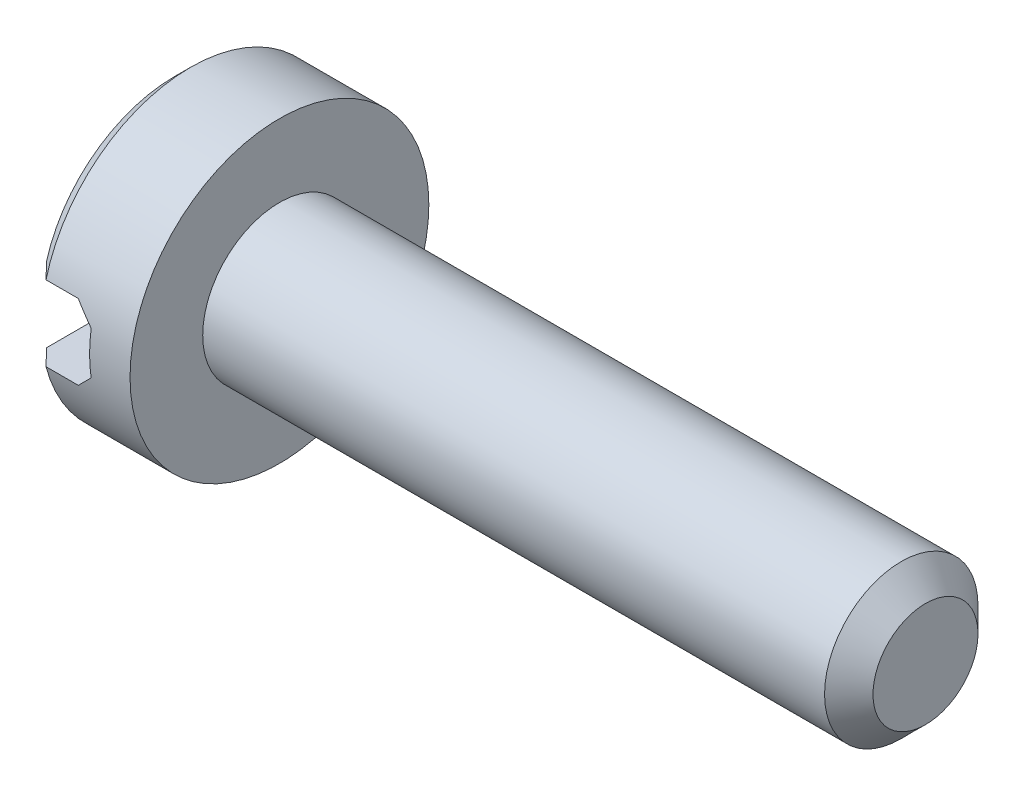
from build123d import *

# Parameters (mm, degrees)
ENL_V_MAT_EXTRU_1_DEPTH = 5
ESQUISSE3_R             = 0.95
EXTRUSION1_DEPTH        = 8
CHANFREIN1_SIZE         = 0.3


with BuildPart() as part:
    # Esquisse1 → R_volution1 (revolve)
    with BuildSketch(Plane.XY, mode=Mode.PRIVATE) as r_volution1_sk:
        Polygon((0, 0), (0, 1.65), (0.2, 1.85), (1.3, 1.85), (1.3, 0), align=None)
    revolve(r_volution1_sk.sketch.rotate(Axis((0, 0, 0), (1, 0, 0)), 90), axis=Axis((0, 0, 0), (1, 0, 0)))

    # Esquisse2 → Enl_v. mat.-Extru.1 (cut, symmetric)
    with BuildSketch(Plane.XY):
        Polygon((0, 0.465549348), (0.6, 0.465549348), (0.8, 0.265549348), (0.8, -0.265549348), (0.6, -0.465549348), (0, -0.465549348), align=None)
    extrude(amount=ENL_V_MAT_EXTRU_1_DEPTH, both=True, mode=Mode.SUBTRACT)

    # Esquisse3 → Extrusion1 (add)
    with BuildSketch(Plane(origin=(1.3, 0, 0), x_dir=(0, 0, -1), z_dir=(1, 0, 0))):
        with Locations(Location((0, 0, 0), (0, 0, 180))):
            Circle(ESQUISSE3_R)
    extrude(amount=EXTRUSION1_DEPTH)

    # Chanfrein1
    chanfrein1_edges = [part.edges().sort_by_distance(p)[0] for p in [
        (9.3, 0, -0.95),
    ]]
    chamfer(chanfrein1_edges, length=CHANFREIN1_SIZE)


solid = part.part
